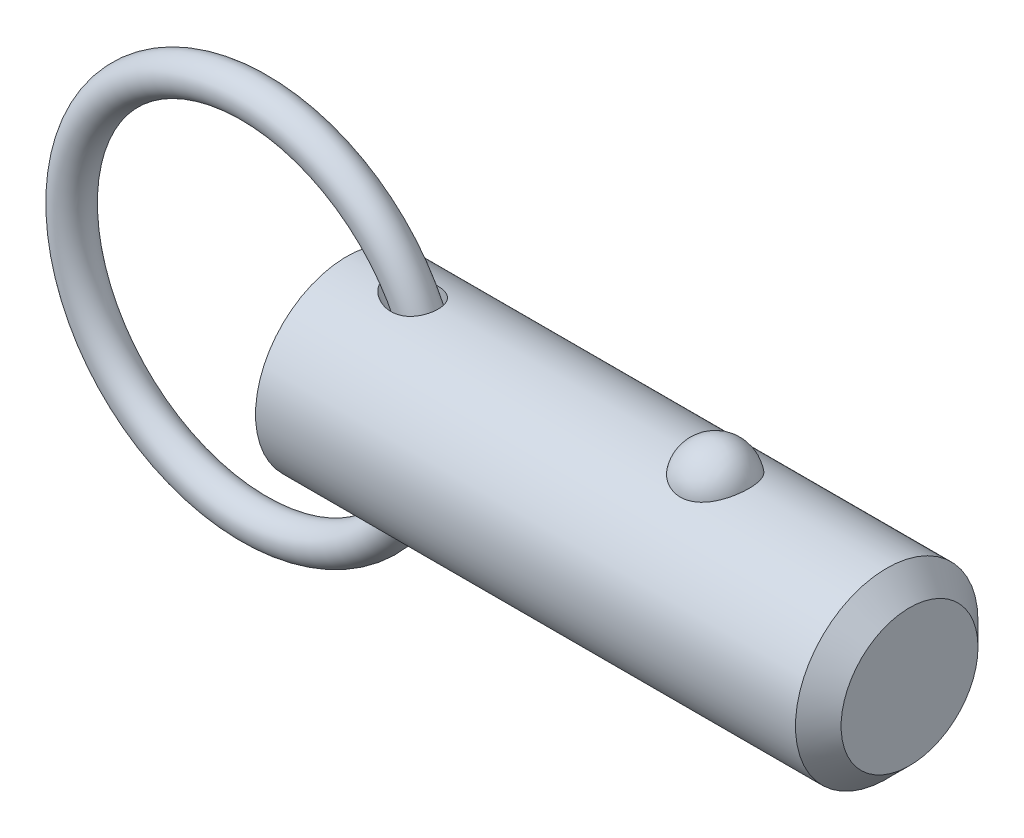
ISO-10303-21;
HEADER;
FILE_DESCRIPTION(('STEP AP214'),'2;1');
FILE_NAME('part.step','',(''),(''),'','','');
FILE_SCHEMA(('AUTOMOTIVE_DESIGN { 1 0 10303 214 1 1 1 1 }'));
ENDSEC;
DATA;
#1=APPLICATION_CONTEXT('core data for automotive mechanical design processes');
#2=APPLICATION_PROTOCOL_DEFINITION('international standard','automotive_design',2000,#1);
#3=PRODUCT_CONTEXT('',#1,'mechanical');
#4=PRODUCT('Part','Part','',(#3));
#5=PRODUCT_RELATED_PRODUCT_CATEGORY('part','',(#4));
#6=PRODUCT_DEFINITION_FORMATION('','',#4);
#7=PRODUCT_DEFINITION_CONTEXT('part definition',#1,'design');
#8=PRODUCT_DEFINITION('design','',#6,#7);
#9=PRODUCT_DEFINITION_SHAPE('','',#8);
#10=(LENGTH_UNIT() NAMED_UNIT(*) SI_UNIT(.MILLI.,.METRE.));
#11=(NAMED_UNIT(*) PLANE_ANGLE_UNIT() SI_UNIT($,.RADIAN.));
#12=(NAMED_UNIT(*) SI_UNIT($,.STERADIAN.) SOLID_ANGLE_UNIT());
#13=UNCERTAINTY_MEASURE_WITH_UNIT(LENGTH_MEASURE(1.E-05),#10,'distance_accuracy_value','');
#14=(GEOMETRIC_REPRESENTATION_CONTEXT(3) GLOBAL_UNCERTAINTY_ASSIGNED_CONTEXT((#13)) GLOBAL_UNIT_ASSIGNED_CONTEXT((#10,
#11,#12)) REPRESENTATION_CONTEXT('',''));
#15=CARTESIAN_POINT('',(0.,0.,0.));
#16=DIRECTION('',(0.,0.,1.));
#17=DIRECTION('',(1.,0.,0.));
#18=AXIS2_PLACEMENT_3D('',#15,#16,#17);
#19=CARTESIAN_POINT('',(-9.66825126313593,0.,0.));
#20=DIRECTION('',(0.,0.,1.));
#21=DIRECTION('',(1.,0.,0.));
#22=AXIS2_PLACEMENT_3D('',#19,#20,#21);
#23=TOROIDAL_SURFACE('',#22,19.05,1.905);
#24=CARTESIAN_POINT('',(11.2867487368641,0.,0.));
#25=VERTEX_POINT('',#24);
#26=VERTEX_LOOP('',#25);
#27=FACE_BOUND('',#26,.T.);
#28=ADVANCED_FACE('P0_F12',(#27),#23,.T.);
#29=CLOSED_SHELL('',(#28));
#30=MANIFOLD_SOLID_BREP('P0_B1',#29);
#31=CARTESIAN_POINT('',(0.,0.,0.));
#32=DIRECTION('',(1.,0.,0.));
#33=DIRECTION('',(0.,0.,-1.));
#34=AXIS2_PLACEMENT_3D('',#31,#32,#33);
#35=CYLINDRICAL_SURFACE('',#34,9.525);
#36=CARTESIAN_POINT('',(4.56693409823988,9.43141941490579,-1.33189820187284));
#37=CARTESIAN_POINT('',(4.70260475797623,9.41020313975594,-1.48215931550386));
#38=CARTESIAN_POINT('',(4.85555680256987,9.38755003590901,-1.61683982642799));
#39=CARTESIAN_POINT('',(5.10171959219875,9.35450554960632,-1.79512943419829));
#40=CARTESIAN_POINT('',(5.18674514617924,9.34362629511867,-1.85068909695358));
#41=CARTESIAN_POINT('',(5.36154389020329,9.32258514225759,-1.95392002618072));
#42=CARTESIAN_POINT('',(5.45131542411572,9.31242299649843,-2.00159402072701));
#43=CARTESIAN_POINT('',(5.70070211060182,9.28632120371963,-2.12033289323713));
#44=CARTESIAN_POINT('',(5.86420408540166,9.27146938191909,-2.18362944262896));
#45=CARTESIAN_POINT('',(6.19893345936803,9.24694163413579,-2.28525783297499));
#46=CARTESIAN_POINT('',(6.37015384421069,9.23726110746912,-2.32361187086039));
#47=CARTESIAN_POINT('',(6.73531776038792,9.22400982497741,-2.37575048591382));
#48=CARTESIAN_POINT('',(6.92975826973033,9.22118808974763,-2.38652934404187));
#49=CARTESIAN_POINT('',(7.21995443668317,9.22416297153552,-2.37494980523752));
#50=CARTESIAN_POINT('',(7.31643847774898,9.22635560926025,-2.366466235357));
#51=CARTESIAN_POINT('',(7.50796421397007,9.2331428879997,-2.33985028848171));
#52=CARTESIAN_POINT('',(7.60300650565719,9.23773650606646,-2.32172202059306));
#53=CARTESIAN_POINT('',(7.83273114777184,9.25183311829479,-2.26504721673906));
#54=CARTESIAN_POINT('',(7.96603028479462,9.26261470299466,-2.2209856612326));
#55=CARTESIAN_POINT('',(8.22310899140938,9.28816519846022,-2.11157306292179));
#56=CARTESIAN_POINT('',(8.34689477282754,9.30293147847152,-2.04623606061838));
#57=CARTESIAN_POINT('',(8.58136049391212,9.3349416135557,-1.89485344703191));
#58=CARTESIAN_POINT('',(8.69199721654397,9.35219324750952,-1.80874222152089));
#59=CARTESIAN_POINT('',(8.89592093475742,9.38707016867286,-1.61799188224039));
#60=CARTESIAN_POINT('',(8.98920771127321,9.40469546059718,-1.51335253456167));
#61=CARTESIAN_POINT('',(9.15057731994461,9.43713590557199,-1.29519427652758));
#62=CARTESIAN_POINT('',(9.21980158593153,9.45205440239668,-1.18253282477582));
#63=CARTESIAN_POINT('',(9.33826736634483,9.47856708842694,-0.946802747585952));
#64=CARTESIAN_POINT('',(9.38751161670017,9.49016173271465,-0.823735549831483));
#65=CARTESIAN_POINT('',(9.46423850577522,9.50859378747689,-0.572614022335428));
#66=CARTESIAN_POINT('',(9.49202393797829,9.5154972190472,-0.444656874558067));
#67=CARTESIAN_POINT('',(9.52636926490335,9.52406905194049,-0.185752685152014));
#68=CARTESIAN_POINT('',(9.53292923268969,9.52573747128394,-0.0548056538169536));
#69=CARTESIAN_POINT('',(9.52467276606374,9.52365852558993,0.206503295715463));
#70=CARTESIAN_POINT('',(9.50983454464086,9.51990564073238,0.336864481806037));
#71=CARTESIAN_POINT('',(9.45907362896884,9.50737852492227,0.59316631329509));
#72=CARTESIAN_POINT('',(9.42315106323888,9.49860432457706,0.71910698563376));
#73=CARTESIAN_POINT('',(9.33106648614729,9.47698928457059,0.96295935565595));
#74=CARTESIAN_POINT('',(9.27490839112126,9.46414923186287,1.08087260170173));
#75=CARTESIAN_POINT('',(9.14375803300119,9.43581000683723,1.30534632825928));
#76=CARTESIAN_POINT('',(9.06876720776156,9.42031103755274,1.41190767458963));
#77=CARTESIAN_POINT('',(8.90203187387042,9.38836719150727,1.61069439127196));
#78=CARTESIAN_POINT('',(8.81029913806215,9.37192298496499,1.70292975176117));
#79=CARTESIAN_POINT('',(8.61268775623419,9.33985045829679,1.87086859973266));
#80=CARTESIAN_POINT('',(8.50680947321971,9.3242221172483,1.94657251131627));
#81=CARTESIAN_POINT('',(8.28220546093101,9.29513431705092,2.08109032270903));
#82=CARTESIAN_POINT('',(8.16329919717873,9.28171415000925,2.1396103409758));
#83=CARTESIAN_POINT('',(7.91756052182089,9.25859072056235,2.23755716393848));
#84=CARTESIAN_POINT('',(7.79072606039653,9.24888842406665,2.27697900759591));
#85=CARTESIAN_POINT('',(7.52377913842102,9.23338749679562,2.33907806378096));
#86=CARTESIAN_POINT('',(7.38334767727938,9.22789571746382,2.36044900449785));
#87=CARTESIAN_POINT('',(7.10081394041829,9.22210229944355,2.3829751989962));
#88=CARTESIAN_POINT('',(6.95871103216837,9.22180269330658,2.38412253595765));
#89=CARTESIAN_POINT('',(6.65642691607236,9.22632724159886,2.36656230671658));
#90=CARTESIAN_POINT('',(6.49641694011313,9.23185415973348,2.3451317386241));
#91=CARTESIAN_POINT('',(6.18115433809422,9.24811737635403,2.28014143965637));
#92=CARTESIAN_POINT('',(6.02590710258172,9.25885936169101,2.23655754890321));
#93=CARTESIAN_POINT('',(5.6990472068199,9.28624254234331,2.12025087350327));
#94=CARTESIAN_POINT('',(5.52873601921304,9.30354853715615,2.04400672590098));
#95=CARTESIAN_POINT('',(5.20289495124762,9.34106989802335,1.86504730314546));
#96=CARTESIAN_POINT('',(5.04735968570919,9.36128419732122,1.76234172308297));
#97=CARTESIAN_POINT('',(4.79287124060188,9.39697639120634,1.55895334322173));
#98=CARTESIAN_POINT('',(4.68938704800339,9.41240250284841,1.46392900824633));
#99=CARTESIAN_POINT('',(4.49847141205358,9.44202586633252,1.25875918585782));
#100=CARTESIAN_POINT('',(4.41101129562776,9.45622528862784,1.1486413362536));
#101=CARTESIAN_POINT('',(4.27502257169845,9.47888210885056,0.940600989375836));
#102=CARTESIAN_POINT('',(4.22216329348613,9.48791121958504,0.845586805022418));
#103=CARTESIAN_POINT('',(4.13241478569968,9.50344321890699,0.648051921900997));
#104=CARTESIAN_POINT('',(4.09551182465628,9.50994827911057,0.545537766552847));
#105=CARTESIAN_POINT('',(4.04043124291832,9.51971586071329,0.334452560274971));
#106=CARTESIAN_POINT('',(4.02240728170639,9.52295176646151,0.225839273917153));
#107=CARTESIAN_POINT('',(4.00750873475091,9.52562364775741,0.00713006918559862));
#108=CARTESIAN_POINT('',(4.01062334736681,9.52506156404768,-0.10296506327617));
#109=CARTESIAN_POINT('',(4.03592967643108,9.52053221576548,-0.306944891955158));
#110=CARTESIAN_POINT('',(4.05571676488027,9.51699426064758,-0.401151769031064));
#111=CARTESIAN_POINT('',(4.10967975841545,9.5074546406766,-0.585176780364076));
#112=CARTESIAN_POINT('',(4.14385995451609,9.50145224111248,-0.674993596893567));
#113=CARTESIAN_POINT('',(4.23261356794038,9.48611703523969,-0.866116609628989));
#114=CARTESIAN_POINT('',(4.28990016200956,9.47635800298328,-0.96612166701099));
#115=CARTESIAN_POINT('',(4.41856577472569,9.45502867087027,-1.15640011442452));
#116=CARTESIAN_POINT('',(4.48996918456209,9.44345524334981,-1.24665623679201));
#117=CARTESIAN_POINT('',(4.56693409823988,9.43141941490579,-1.33189820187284));
#118=B_SPLINE_CURVE_WITH_KNOTS('',3,(#36,#37,#38,#39,#40,#41,#42,#43,#44,#45,#46,#47,#48,#49,
#50,#51,#52,#53,#54,#55,#56,#57,#58,#59,#60,#61,#62,#63,#64,#65,#66,#67,#68,#69,#70,#71,#72,#73,
#74,#75,#76,#77,#78,#79,#80,#81,#82,#83,#84,#85,#86,#87,#88,#89,#90,#91,#92,#93,#94,#95,#96,#97,
#98,#99,#100,#101,#102,#103,#104,#105,#106,#107,#108,#109,#110,#111,#112,#113,#114,#115,#116,
#117),.UNSPECIFIED.,.T.,.F.,(4,2,2,2,2,2,2,2,2,2,2,2,2,2,2,2,2,2,2,2,2,2,2,2,2,2,2,2,2,2,2,2,2,
2,2,2,2,2,2,2,4),(0.,0.609951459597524,0.916123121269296,1.22218863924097,1.74791337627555,
2.27316961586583,2.85362722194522,3.14383229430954,3.43391382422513,3.85437497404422,
4.27455920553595,4.69608835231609,5.11762282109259,5.5149005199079,5.91212379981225,
6.30363414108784,6.69514313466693,7.08705103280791,7.47895654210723,7.87078624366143,
8.26258603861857,8.65411137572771,9.04562666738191,9.44349251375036,9.84146165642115,
10.2662286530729,10.6911619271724,11.1739180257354,11.6572017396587,12.2170157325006,
12.776624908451,13.1992556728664,13.6211226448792,13.9471990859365,14.2729943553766,
14.6014211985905,14.9296802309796,15.2173810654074,15.505167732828,15.8505863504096,
16.1966070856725),.UNSPECIFIED.);
#119=CARTESIAN_POINT('',(4.56693409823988,9.43141941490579,-1.33189820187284));
#120=VERTEX_POINT('',#119);
#121=EDGE_CURVE('P1_E40',#120,#120,#118,.T.);
#122=ORIENTED_EDGE('',*,*,#121,.T.);
#123=EDGE_LOOP('',(#122));
#124=FACE_BOUND('',#123,.T.);
#125=CARTESIAN_POINT('',(56.34875,0.,0.));
#126=DIRECTION('',(1.,0.,0.));
#127=DIRECTION('',(0.,0.,-1.));
#128=AXIS2_PLACEMENT_3D('',#125,#126,#127);
#129=CIRCLE('',#128,9.525);
#130=CARTESIAN_POINT('',(56.34875,0.,-9.525));
#131=VERTEX_POINT('',#130);
#132=EDGE_CURVE('P1_E25',#131,#131,#129,.T.);
#133=ORIENTED_EDGE('',*,*,#132,.F.);
#134=EDGE_LOOP('',(#133));
#135=FACE_BOUND('',#134,.T.);
#136=CARTESIAN_POINT('',(0.,0.,0.));
#137=DIRECTION('',(1.,0.,0.));
#138=DIRECTION('',(0.,0.,-1.));
#139=AXIS2_PLACEMENT_3D('',#136,#137,#138);
#140=CIRCLE('',#139,9.525);
#141=CARTESIAN_POINT('',(0.,0.,-9.525));
#142=VERTEX_POINT('',#141);
#143=EDGE_CURVE('P1_E9',#142,#142,#140,.T.);
#144=ORIENTED_EDGE('',*,*,#143,.T.);
#145=EDGE_LOOP('',(#144));
#146=FACE_BOUND('',#145,.T.);
#147=CARTESIAN_POINT('',(38.4457573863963,8.80405803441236,3.63513233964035));
#148=CARTESIAN_POINT('',(38.3516766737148,8.80405953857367,3.63513053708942));
#149=CARTESIAN_POINT('',(38.2575618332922,8.80561325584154,3.6313746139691));
#150=CARTESIAN_POINT('',(38.0700126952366,8.81177748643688,3.61638665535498));
#151=CARTESIAN_POINT('',(37.9765788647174,8.81638992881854,3.60514990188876));
#152=CARTESIAN_POINT('',(37.6979452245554,8.8346711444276,3.56024627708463));
#153=CARTESIAN_POINT('',(37.5146916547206,8.85278327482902,3.51538626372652));
#154=CARTESIAN_POINT('',(37.159509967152,8.89871214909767,3.39742145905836));
#155=CARTESIAN_POINT('',(36.9875533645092,8.9265032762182,3.32439116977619));
#156=CARTESIAN_POINT('',(36.658707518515,8.98874819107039,3.1522024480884));
#157=CARTESIAN_POINT('',(36.5018114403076,9.02319893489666,3.05305594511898));
#158=CARTESIAN_POINT('',(36.2022147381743,9.09629186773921,2.82797815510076));
#159=CARTESIAN_POINT('',(36.0600600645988,9.13502685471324,2.7013513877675));
#160=CARTESIAN_POINT('',(35.7982999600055,9.2118657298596,2.4264193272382));
#161=CARTESIAN_POINT('',(35.6787015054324,9.2499694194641,2.27810735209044));
#162=CARTESIAN_POINT('',(35.459645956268,9.32341082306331,1.95652290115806));
#163=CARTESIAN_POINT('',(35.3613174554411,9.35855090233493,1.78243511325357));
#164=CARTESIAN_POINT('',(35.1938190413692,9.42045142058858,1.41937246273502));
#165=CARTESIAN_POINT('',(35.1246511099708,9.44721128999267,1.23039658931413));
#166=CARTESIAN_POINT('',(35.0161994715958,9.48990641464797,0.840370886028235));
#167=CARTESIAN_POINT('',(34.9772880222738,9.50570658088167,0.63920250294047));
#168=CARTESIAN_POINT('',(34.9315550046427,9.52433146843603,0.232664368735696));
#169=CARTESIAN_POINT('',(34.9247324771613,9.52715657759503,0.0272947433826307));
#170=CARTESIAN_POINT('',(34.943255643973,9.51956918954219,-0.380478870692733));
#171=CARTESIAN_POINT('',(34.9684052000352,9.50923740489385,-0.582893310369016));
#172=CARTESIAN_POINT('',(35.0500253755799,9.47651897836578,-0.980293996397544));
#173=CARTESIAN_POINT('',(35.1064966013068,9.45413210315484,-1.17528009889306));
#174=CARTESIAN_POINT('',(35.2497192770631,9.39954044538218,-1.55263697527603));
#175=CARTESIAN_POINT('',(35.3365124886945,9.36732213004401,-1.73498993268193));
#176=CARTESIAN_POINT('',(35.5386103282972,9.29640700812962,-2.08177763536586));
#177=CARTESIAN_POINT('',(35.6539172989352,9.25770966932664,-2.24621090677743));
#178=CARTESIAN_POINT('',(35.911264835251,9.17775604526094,-2.5533833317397));
#179=CARTESIAN_POINT('',(36.0534344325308,9.136488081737,-2.696011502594));
#180=CARTESIAN_POINT('',(36.36089985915,9.05620497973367,-2.95451229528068));
#181=CARTESIAN_POINT('',(36.5261937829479,9.01718965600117,-3.07038711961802));
#182=CARTESIAN_POINT('',(36.872052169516,8.9468001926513,-3.26976836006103));
#183=CARTESIAN_POINT('',(37.0522278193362,8.91528408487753,-3.35389750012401));
#184=CARTESIAN_POINT('',(37.4256514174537,8.86272514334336,-3.49043503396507));
#185=CARTESIAN_POINT('',(37.6188944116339,8.8416783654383,-3.54285537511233));
#186=CARTESIAN_POINT('',(38.0025036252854,8.81348056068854,-3.61241306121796));
#187=CARTESIAN_POINT('',(38.1925251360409,8.80568348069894,-3.63119339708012));
#188=CARTESIAN_POINT('',(38.5731906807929,8.80289410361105,-3.63795342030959));
#189=CARTESIAN_POINT('',(38.7638345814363,8.80789922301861,-3.62593932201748));
#190=CARTESIAN_POINT('',(39.134007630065,8.8297491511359,-3.57238430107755));
#191=CARTESIAN_POINT('',(39.3136976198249,8.84621463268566,-3.53178890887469));
#192=CARTESIAN_POINT('',(39.6634226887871,8.88875330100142,-3.42331083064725));
#193=CARTESIAN_POINT('',(39.8334569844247,8.91482726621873,-3.35542593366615));
#194=CARTESIAN_POINT('',(40.1632377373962,8.97448239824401,-3.19248225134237));
#195=CARTESIAN_POINT('',(40.3226801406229,9.00821446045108,-3.09686474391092));
#196=CARTESIAN_POINT('',(40.6235136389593,9.07935398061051,-2.88162736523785));
#197=CARTESIAN_POINT('',(40.7649005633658,9.11676228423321,-2.76200196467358));
#198=CARTESIAN_POINT('',(41.0333193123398,9.19347419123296,-2.49516285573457));
#199=CARTESIAN_POINT('',(41.1592750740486,9.23277872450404,-2.34686614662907));
#200=CARTESIAN_POINT('',(41.3855227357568,9.30737610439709,-2.03093683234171));
#201=CARTESIAN_POINT('',(41.4858100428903,9.34266823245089,-1.86330077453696));
#202=CARTESIAN_POINT('',(41.6615149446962,9.40674710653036,-1.50744893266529));
#203=CARTESIAN_POINT('',(41.736041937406,9.4352917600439,-1.31874876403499));
#204=CARTESIAN_POINT('',(41.8541650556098,9.48144132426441,-0.930631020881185));
#205=CARTESIAN_POINT('',(41.8977608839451,9.49904612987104,-0.731213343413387));
#206=CARTESIAN_POINT('',(41.9531580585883,9.5215314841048,-0.327147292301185));
#207=CARTESIAN_POINT('',(41.9649354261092,9.52640243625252,-0.122495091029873));
#208=CARTESIAN_POINT('',(41.9563825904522,9.52289571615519,0.286018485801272));
#209=CARTESIAN_POINT('',(41.9360530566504,9.51451832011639,0.48987987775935));
#210=CARTESIAN_POINT('',(41.8638840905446,9.48544083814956,0.889994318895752));
#211=CARTESIAN_POINT('',(41.8121993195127,9.46480124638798,1.08627971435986));
#212=CARTESIAN_POINT('',(41.6784917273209,9.4133389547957,1.46682086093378));
#213=CARTESIAN_POINT('',(41.5964668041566,9.38251554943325,1.65107577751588));
#214=CARTESIAN_POINT('',(41.4031929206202,9.31365636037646,2.00346348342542));
#215=CARTESIAN_POINT('',(41.2917838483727,9.27558138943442,2.17150083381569));
#216=CARTESIAN_POINT('',(41.0422947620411,9.19638714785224,2.48563115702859));
#217=CARTESIAN_POINT('',(40.9042163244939,9.15526805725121,2.63172542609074));
#218=CARTESIAN_POINT('',(40.6048438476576,9.07465393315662,2.89750997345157));
#219=CARTESIAN_POINT('',(40.4436109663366,9.03515496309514,3.01726776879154));
#220=CARTESIAN_POINT('',(40.1016136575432,8.96227564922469,3.22732920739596));
#221=CARTESIAN_POINT('',(39.920841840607,8.92889763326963,3.31762165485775));
#222=CARTESIAN_POINT('',(39.5514451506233,8.8734538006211,3.46314419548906));
#223=CARTESIAN_POINT('',(39.3633237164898,8.85102983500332,3.51950082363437));
#224=CARTESIAN_POINT('',(39.0757869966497,8.82666967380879,3.57993683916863));
#225=CARTESIAN_POINT('',(38.9791339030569,8.82009725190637,3.59606217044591));
#226=CARTESIAN_POINT('',(38.7846770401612,8.81020897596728,3.62022512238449));
#227=CARTESIAN_POINT('',(38.6868741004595,8.80689090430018,3.62826825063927));
#228=CARTESIAN_POINT('',(38.5412243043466,8.80445615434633,3.63416760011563));
#229=CARTESIAN_POINT('',(38.4934952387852,8.80405727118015,3.63513325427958));
#230=CARTESIAN_POINT('',(38.4457573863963,8.80405803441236,3.63513233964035));
#231=B_SPLINE_CURVE_WITH_KNOTS('',3,(#147,#148,#149,#150,#151,#152,#153,#154,#155,#156,#157,
#158,#159,#160,#161,#162,#163,#164,#165,#166,#167,#168,#169,#170,#171,#172,#173,#174,#175,#176,
#177,#178,#179,#180,#181,#182,#183,#184,#185,#186,#187,#188,#189,#190,#191,#192,#193,#194,#195,
#196,#197,#198,#199,#200,#201,#202,#203,#204,#205,#206,#207,#208,#209,#210,#211,#212,#213,#214,
#215,#216,#217,#218,#219,#220,#221,#222,#223,#224,#225,#226,#227,#228,#229,#230),.UNSPECIFIED.,
.T.,.F.,(4,2,2,2,2,2,2,2,2,2,2,2,2,2,2,2,2,2,2,2,2,2,2,2,2,2,2,2,2,2,2,2,2,2,2,2,2,2,2,2,2,4),
(0.,0.282202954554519,0.564584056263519,1.13017050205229,1.69427128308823,2.25811483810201,
2.83836627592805,3.41879688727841,4.02497117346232,4.63118665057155,5.24474754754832,
5.85829010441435,6.46808687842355,7.0778954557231,7.68854723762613,8.29924920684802,
8.91296283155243,9.52662591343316,10.1275338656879,10.7282152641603,11.2986646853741,
11.868998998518,12.4213015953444,12.9736489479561,13.5380053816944,14.1024919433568,
14.695298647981,15.2882113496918,15.8999469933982,16.5116885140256,17.1238909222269,
17.7360805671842,18.3452748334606,18.9545113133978,19.567138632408,20.1797297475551,
20.7907316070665,21.4019653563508,21.9915938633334,22.2859053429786,22.580016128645,
22.723209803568),.UNSPECIFIED.);
#232=CARTESIAN_POINT('',(38.4457573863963,8.80405803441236,3.63513233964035));
#233=VERTEX_POINT('',#232);
#234=EDGE_CURVE('P1_E34',#233,#233,#231,.T.);
#235=ORIENTED_EDGE('',*,*,#234,.T.);
#236=EDGE_LOOP('',(#235));
#237=FACE_BOUND('',#236,.T.);
#238=CARTESIAN_POINT('',(4.56693409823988,-9.43141941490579,-1.33189820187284));
#239=CARTESIAN_POINT('',(4.48932984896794,-9.4435553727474,-1.24594548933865));
#240=CARTESIAN_POINT('',(4.41737309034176,-9.45522193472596,-1.1548795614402));
#241=CARTESIAN_POINT('',(4.2878104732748,-9.47670896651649,-0.962782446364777));
#242=CARTESIAN_POINT('',(4.23019403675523,-9.48653079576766,-0.861758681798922));
#243=CARTESIAN_POINT('',(4.13254559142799,-9.5034118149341,-0.649723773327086));
#244=CARTESIAN_POINT('',(4.09271158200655,-9.51043980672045,-0.538615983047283));
#245=CARTESIAN_POINT('',(4.04973167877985,-9.51806966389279,-0.367764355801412));
#246=CARTESIAN_POINT('',(4.03820037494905,-9.52012756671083,-0.310118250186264));
#247=CARTESIAN_POINT('',(4.02100287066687,-9.52320274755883,-0.193935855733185));
#248=CARTESIAN_POINT('',(4.01533565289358,-9.52422020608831,-0.13539972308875));
#249=CARTESIAN_POINT('',(4.00817074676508,-9.52550497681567,0.0247266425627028));
#250=CARTESIAN_POINT('',(4.01270492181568,-9.52468821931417,0.126661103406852));
#251=CARTESIAN_POINT('',(4.0395497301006,-9.51988506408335,0.328012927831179));
#252=CARTESIAN_POINT('',(4.0618645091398,-9.51589792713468,0.427429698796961));
#253=CARTESIAN_POINT('',(4.12088980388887,-9.5054852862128,0.61636200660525));
#254=CARTESIAN_POINT('',(4.15684838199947,-9.49918763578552,0.706123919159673));
#255=CARTESIAN_POINT('',(4.24094647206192,-9.48470618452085,0.879522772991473));
#256=CARTESIAN_POINT('',(4.28909090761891,-9.47652162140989,0.96315722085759));
#257=CARTESIAN_POINT('',(4.42295891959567,-9.45426317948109,1.16513741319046));
#258=CARTESIAN_POINT('',(4.51523752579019,-9.43933320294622,1.27905352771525));
#259=CARTESIAN_POINT('',(4.71682295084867,-9.40825940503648,1.49055892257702));
#260=CARTESIAN_POINT('',(4.8261728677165,-9.39211256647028,1.58810554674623));
#261=CARTESIAN_POINT('',(5.09064226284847,-9.35555264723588,1.79246125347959));
#262=CARTESIAN_POINT('',(5.24990411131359,-9.33524115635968,1.89393122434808));
#263=CARTESIAN_POINT('',(5.58309255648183,-9.29785396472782,2.06968659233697));
#264=CARTESIAN_POINT('',(5.75702897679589,-9.28078045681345,2.14395359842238));
#265=CARTESIAN_POINT('',(6.11646882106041,-9.25213303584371,2.26440412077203));
#266=CARTESIAN_POINT('',(6.3020558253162,-9.2406056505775,2.31035092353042));
#267=CARTESIAN_POINT('',(6.67856093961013,-9.22541807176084,2.37029728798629));
#268=CARTESIAN_POINT('',(6.86947045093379,-9.2217458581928,2.3843456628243));
#269=CARTESIAN_POINT('',(7.21217144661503,-9.22344239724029,2.37775005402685));
#270=CARTESIAN_POINT('',(7.36409439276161,-9.22713860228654,2.36352577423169));
#271=CARTESIAN_POINT('',(7.66346227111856,-9.24048072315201,2.31082299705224));
#272=CARTESIAN_POINT('',(7.81090958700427,-9.25012341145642,2.27235765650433));
#273=CARTESIAN_POINT('',(8.09730316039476,-9.2746609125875,2.17003648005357));
#274=CARTESIAN_POINT('',(8.23619652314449,-9.28958517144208,2.10603803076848));
#275=CARTESIAN_POINT('',(8.49918675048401,-9.32290326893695,1.9532444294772));
#276=CARTESIAN_POINT('',(8.62328895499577,-9.34129584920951,1.86445826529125));
#277=CARTESIAN_POINT('',(8.84006515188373,-9.37706953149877,1.67466761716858));
#278=CARTESIAN_POINT('',(8.93465172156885,-9.39436331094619,1.57582357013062));
#279=CARTESIAN_POINT('',(9.1049023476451,-9.42761680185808,1.362809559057));
#280=CARTESIAN_POINT('',(9.18057146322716,-9.44357686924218,1.24864370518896));
#281=CARTESIAN_POINT('',(9.30789178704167,-9.47159985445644,1.01379272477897));
#282=CARTESIAN_POINT('',(9.3604554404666,-9.48380365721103,0.893617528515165));
#283=CARTESIAN_POINT('',(9.44498362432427,-9.50388751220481,0.645890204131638));
#284=CARTESIAN_POINT('',(9.47694947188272,-9.51176784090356,0.518338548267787));
#285=CARTESIAN_POINT('',(9.51944262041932,-9.52232073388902,0.260103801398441));
#286=CARTESIAN_POINT('',(9.53006646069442,-9.52501674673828,0.129437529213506));
#287=CARTESIAN_POINT('',(9.52993291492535,-9.52498309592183,-0.131885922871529));
#288=CARTESIAN_POINT('',(9.51917525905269,-9.52225336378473,-0.262543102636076));
#289=CARTESIAN_POINT('',(9.47648788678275,-9.51165418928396,-0.520312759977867));
#290=CARTESIAN_POINT('',(9.44453086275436,-9.50377811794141,-0.647420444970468));
#291=CARTESIAN_POINT('',(9.36015568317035,-9.48373425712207,-0.894290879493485));
#292=CARTESIAN_POINT('',(9.30773827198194,-9.47156662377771,-1.01405389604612));
#293=CARTESIAN_POINT('',(9.18380895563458,-9.44428888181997,-1.24269386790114));
#294=CARTESIAN_POINT('',(9.11232064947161,-9.42918241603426,-1.3515840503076));
#295=CARTESIAN_POINT('',(8.95212687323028,-9.39767706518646,-1.55562459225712));
#296=CARTESIAN_POINT('',(8.86342281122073,-9.3812782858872,-1.65077607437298));
#297=CARTESIAN_POINT('',(8.67104443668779,-9.34891827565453,-1.82517515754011));
#298=CARTESIAN_POINT('',(8.56732858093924,-9.33295841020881,-1.90437711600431));
#299=CARTESIAN_POINT('',(8.34818438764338,-9.30317889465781,-2.0449122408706));
#300=CARTESIAN_POINT('',(8.23275529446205,-9.2893593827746,-2.10624425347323));
#301=CARTESIAN_POINT('',(7.98961240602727,-9.26475003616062,-2.2120340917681));
#302=CARTESIAN_POINT('',(7.86162088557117,-9.25407358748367,-2.25587700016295));
#303=CARTESIAN_POINT('',(7.60027499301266,-9.23720810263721,-2.32397032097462));
#304=CARTESIAN_POINT('',(7.46691858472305,-9.23102078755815,-2.34821321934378));
#305=CARTESIAN_POINT('',(7.18516230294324,-9.22302718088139,-2.37943079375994));
#306=CARTESIAN_POINT('',(7.0365445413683,-9.22169704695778,-2.38452997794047));
#307=CARTESIAN_POINT('',(6.74015049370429,-9.22442327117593,-2.37395141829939));
#308=CARTESIAN_POINT('',(6.59237455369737,-9.22848170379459,-2.35826567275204));
#309=CARTESIAN_POINT('',(6.27762777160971,-9.2422287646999,-2.30385559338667));
#310=CARTESIAN_POINT('',(6.11124715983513,-9.25269504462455,-2.26192683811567));
#311=CARTESIAN_POINT('',(5.78635920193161,-9.27830776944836,-2.15445569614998));
#312=CARTESIAN_POINT('',(5.62786567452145,-9.29346211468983,-2.08887341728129));
#313=CARTESIAN_POINT('',(5.3901306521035,-9.31931237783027,-1.96924953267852));
#314=CARTESIAN_POINT('',(5.30683088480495,-9.32901725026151,-1.92292485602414));
#315=CARTESIAN_POINT('',(5.14455801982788,-9.34899035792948,-1.82334419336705));
#316=CARTESIAN_POINT('',(5.06558607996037,-9.35925874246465,-1.77008636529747));
#317=CARTESIAN_POINT('',(4.83670950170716,-9.39034445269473,-1.60010986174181));
#318=CARTESIAN_POINT('',(4.69422471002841,-9.41151337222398,-1.47288240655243));
#319=CARTESIAN_POINT('',(4.56693409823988,-9.43141941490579,-1.33189820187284));
#320=B_SPLINE_CURVE_WITH_KNOTS('',3,(#238,#239,#240,#241,#242,#243,#244,#245,#246,#247,#248,
#249,#250,#251,#252,#253,#254,#255,#256,#257,#258,#259,#260,#261,#262,#263,#264,#265,#266,#267,
#268,#269,#270,#271,#272,#273,#274,#275,#276,#277,#278,#279,#280,#281,#282,#283,#284,#285,#286,
#287,#288,#289,#290,#291,#292,#293,#294,#295,#296,#297,#298,#299,#300,#301,#302,#303,#304,#305,
#306,#307,#308,#309,#310,#311,#312,#313,#314,#315,#316,#317,#318,#319),.UNSPECIFIED.,.T.,.F.,(4,
2,2,2,2,2,2,2,2,2,2,2,2,2,2,2,2,2,2,2,2,2,2,2,2,2,2,2,2,2,2,2,2,2,2,2,2,2,2,2,4),(0.,
0.348900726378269,0.697543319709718,1.0499765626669,1.22617690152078,1.40234666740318,
1.70666745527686,2.01105922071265,2.30066493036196,2.59038784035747,3.03001384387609,
3.4707682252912,4.03766594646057,4.60494622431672,5.17690598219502,5.74798989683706,
6.2040084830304,6.65977977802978,7.11813321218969,7.57632066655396,7.98791759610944,
8.39940433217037,8.79273459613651,9.18603970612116,9.577561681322,9.96908859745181,
10.3611208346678,10.7531388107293,11.1446739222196,11.536177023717,11.9287850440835,
12.3214184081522,12.7268448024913,13.1324265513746,13.5768390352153,14.0214226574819,
14.5351685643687,15.0497849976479,15.3368801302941,15.6240516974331,16.1963372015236),.UNSPECIFIED.);
#321=CARTESIAN_POINT('',(4.56693409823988,-9.43141941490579,-1.33189820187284));
#322=VERTEX_POINT('',#321);
#323=EDGE_CURVE('P1_E17',#322,#322,#320,.T.);
#324=ORIENTED_EDGE('',*,*,#323,.T.);
#325=EDGE_LOOP('',(#324));
#326=FACE_BOUND('',#325,.T.);
#327=ADVANCED_FACE('P1_F13',(#124,#135,#146,#237,#326),#35,.T.);
#328=CARTESIAN_POINT('',(0.,0.,0.));
#329=DIRECTION('',(-1.,0.,0.));
#330=DIRECTION('',(0.,0.,1.));
#331=AXIS2_PLACEMENT_3D('',#328,#329,#330);
#332=PLANE('',#331);
#333=ORIENTED_EDGE('',*,*,#143,.F.);
#334=EDGE_LOOP('',(#333));
#335=FACE_BOUND('',#334,.T.);
#336=ADVANCED_FACE('P1_F15',(#335),#332,.T.);
#337=CARTESIAN_POINT('',(58.73,0.,0.));
#338=DIRECTION('',(-1.,0.,0.));
#339=DIRECTION('',(0.,0.,1.));
#340=AXIS2_PLACEMENT_3D('',#337,#338,#339);
#341=CONICAL_SURFACE('',#340,7.14375000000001,0.785398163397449);
#342=ORIENTED_EDGE('',*,*,#132,.T.);
#343=EDGE_LOOP('',(#342));
#344=FACE_BOUND('',#343,.T.);
#345=CARTESIAN_POINT('',(58.73,0.,0.));
#346=DIRECTION('',(1.,0.,0.));
#347=DIRECTION('',(0.,0.,-1.));
#348=AXIS2_PLACEMENT_3D('',#345,#346,#347);
#349=CIRCLE('',#348,7.14375000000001);
#350=CARTESIAN_POINT('',(58.73,0.,-7.14375000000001));
#351=VERTEX_POINT('',#350);
#352=EDGE_CURVE('P1_E30',#351,#351,#349,.T.);
#353=ORIENTED_EDGE('',*,*,#352,.F.);
#354=EDGE_LOOP('',(#353));
#355=FACE_BOUND('',#354,.T.);
#356=ADVANCED_FACE('P1_F55',(#344,#355),#341,.T.);
#357=CARTESIAN_POINT('',(58.73,7.14375000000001,0.));
#358=DIRECTION('',(1.,0.,0.));
#359=DIRECTION('',(0.,0.,-1.));
#360=AXIS2_PLACEMENT_3D('',#357,#358,#359);
#361=PLANE('',#360);
#362=ORIENTED_EDGE('',*,*,#352,.T.);
#363=EDGE_LOOP('',(#362));
#364=FACE_BOUND('',#363,.T.);
#365=ADVANCED_FACE('P1_F51',(#364),#361,.T.);
#366=CARTESIAN_POINT('',(38.4457573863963,8.5725,0.));
#367=DIRECTION('',(-1.,0.,0.));
#368=DIRECTION('',(0.,-1.,0.));
#369=AXIS2_PLACEMENT_3D('',#366,#367,#368);
#370=SPHERICAL_SURFACE('',#369,3.64250000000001);
#371=ORIENTED_EDGE('',*,*,#234,.F.);
#372=EDGE_LOOP('',(#371));
#373=FACE_BOUND('',#372,.T.);
#374=ADVANCED_FACE('P1_F46',(#373),#370,.T.);
#375=CARTESIAN_POINT('',(-9.66825126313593,0.,0.));
#376=DIRECTION('',(0.,0.,1.));
#377=DIRECTION('',(1.,0.,0.));
#378=AXIS2_PLACEMENT_3D('',#375,#376,#377);
#379=TOROIDAL_SURFACE('',#378,19.05,2.38125);
#380=ORIENTED_EDGE('',*,*,#323,.F.);
#381=EDGE_LOOP('',(#380));
#382=FACE_BOUND('',#381,.T.);
#383=ORIENTED_EDGE('',*,*,#121,.F.);
#384=EDGE_LOOP('',(#383));
#385=FACE_BOUND('',#384,.T.);
#386=ADVANCED_FACE('P1_F50',(#382,#385),#379,.F.);
#387=CLOSED_SHELL('',(#327,#336,#356,#365,#374,#386));
#388=MANIFOLD_SOLID_BREP('P1_B1',#387);
#389=ADVANCED_BREP_SHAPE_REPRESENTATION('',(#18,#30,#388),#14);
#390=SHAPE_DEFINITION_REPRESENTATION(#9,#389);
ENDSEC;
END-ISO-10303-21;
